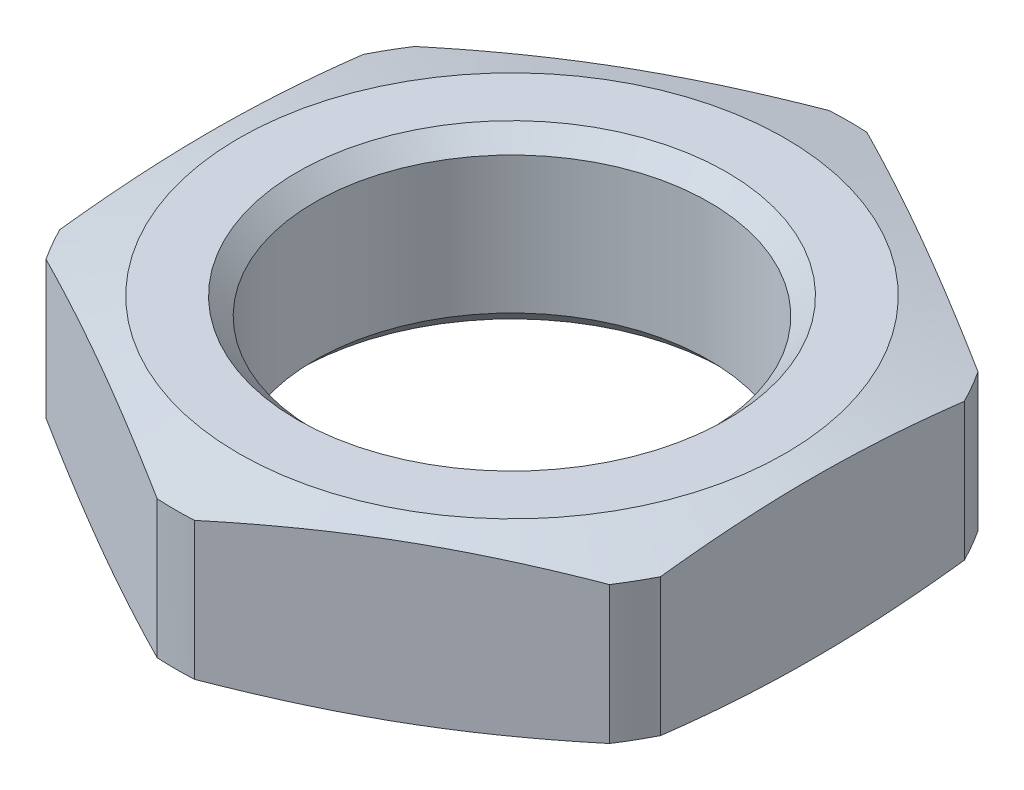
ISO-10303-21;
HEADER;
FILE_DESCRIPTION(('STEP AP214'),'2;1');
FILE_NAME('part.step','',(''),(''),'','','');
FILE_SCHEMA(('AUTOMOTIVE_DESIGN { 1 0 10303 214 1 1 1 1 }'));
ENDSEC;
DATA;
#1=APPLICATION_CONTEXT('core data for automotive mechanical design processes');
#2=APPLICATION_PROTOCOL_DEFINITION('international standard','automotive_design',2000,#1);
#3=PRODUCT_CONTEXT('',#1,'mechanical');
#4=PRODUCT('Part','Part','',(#3));
#5=PRODUCT_RELATED_PRODUCT_CATEGORY('part','',(#4));
#6=PRODUCT_DEFINITION_FORMATION('','',#4);
#7=PRODUCT_DEFINITION_CONTEXT('part definition',#1,'design');
#8=PRODUCT_DEFINITION('design','',#6,#7);
#9=PRODUCT_DEFINITION_SHAPE('','',#8);
#10=(LENGTH_UNIT() NAMED_UNIT(*) SI_UNIT(.MILLI.,.METRE.));
#11=(NAMED_UNIT(*) PLANE_ANGLE_UNIT() SI_UNIT($,.RADIAN.));
#12=(NAMED_UNIT(*) SI_UNIT($,.STERADIAN.) SOLID_ANGLE_UNIT());
#13=UNCERTAINTY_MEASURE_WITH_UNIT(LENGTH_MEASURE(1.E-05),#10,'distance_accuracy_value','');
#14=(GEOMETRIC_REPRESENTATION_CONTEXT(3) GLOBAL_UNCERTAINTY_ASSIGNED_CONTEXT((#13)) GLOBAL_UNIT_ASSIGNED_CONTEXT((#10,
#11,#12)) REPRESENTATION_CONTEXT('',''));
#15=CARTESIAN_POINT('',(0.,0.,0.));
#16=DIRECTION('',(0.,0.,1.));
#17=DIRECTION('',(1.,0.,0.));
#18=AXIS2_PLACEMENT_3D('',#15,#16,#17);
#19=CARTESIAN_POINT('',(0.,0.,0.));
#20=DIRECTION('',(0.,1.,0.));
#21=DIRECTION('',(0.,0.,1.));
#22=AXIS2_PLACEMENT_3D('',#19,#20,#21);
#23=CONICAL_SURFACE('',#22,6.36363636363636,1.30899693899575);
#24=CARTESIAN_POINT('',(0.,0.,0.));
#25=DIRECTION('',(0.,1.,0.));
#26=DIRECTION('',(0.,0.,1.));
#27=AXIS2_PLACEMENT_3D('',#24,#25,#26);
#28=CIRCLE('',#27,6.36363636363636);
#29=CARTESIAN_POINT('',(0.,0.,6.36363636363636));
#30=VERTEX_POINT('',#29);
#31=EDGE_CURVE('E544',#30,#30,#28,.T.);
#32=ORIENTED_EDGE('',*,*,#31,.T.);
#33=EDGE_LOOP('',(#32));
#34=FACE_BOUND('',#33,.T.);
#35=CARTESIAN_POINT('',(0.,0.396431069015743,0.));
#36=DIRECTION('',(0.,1.,0.));
#37=DIRECTION('',(0.,0.,1.));
#38=AXIS2_PLACEMENT_3D('',#35,#36,#37);
#39=CIRCLE('',#38,7.84313725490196);
#40=CARTESIAN_POINT('',(6.56367450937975,0.396431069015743,4.29336452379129));
#41=VERTEX_POINT('',#40);
#42=CARTESIAN_POINT('',(7.,0.396431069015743,3.53762660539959));
#43=VERTEX_POINT('',#42);
#44=EDGE_CURVE('E261',#41,#43,#39,.T.);
#45=ORIENTED_EDGE('',*,*,#44,.F.);
#46=CARTESIAN_POINT('',(-0.000199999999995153,0.4607072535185,8.0830192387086));
#47=CARTESIAN_POINT('',(0.290508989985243,0.415715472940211,7.91517832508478));
#48=CARTESIAN_POINT('',(0.581745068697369,0.37487035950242,7.7470330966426));
#49=CARTESIAN_POINT('',(1.16524574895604,0.303109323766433,7.41014882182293));
#50=CARTESIAN_POINT('',(1.4575107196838,0.272197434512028,7.24140956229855));
#51=CARTESIAN_POINT('',(2.04129717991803,0.222107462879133,6.90436029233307));
#52=CARTESIAN_POINT('',(2.33281472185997,0.20286964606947,6.73605256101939));
#53=CARTESIAN_POINT('',(2.91622156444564,0.177073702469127,6.39922246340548));
#54=CARTESIAN_POINT('',(3.20811078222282,0.170513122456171,6.23070014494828));
#55=CARTESIAN_POINT('',(3.79188921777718,0.170513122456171,5.89365550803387));
#56=CARTESIAN_POINT('',(4.08377843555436,0.177073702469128,5.72513318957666));
#57=CARTESIAN_POINT('',(4.66718527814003,0.20286964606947,5.38830309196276));
#58=CARTESIAN_POINT('',(4.95870282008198,0.222107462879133,5.21999536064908));
#59=CARTESIAN_POINT('',(5.5424892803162,0.272197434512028,4.88294609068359));
#60=CARTESIAN_POINT('',(5.83475425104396,0.303109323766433,4.71420683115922));
#61=CARTESIAN_POINT('',(6.41825493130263,0.37487035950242,4.37732255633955));
#62=CARTESIAN_POINT('',(6.70949101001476,0.415715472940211,4.20917732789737));
#63=CARTESIAN_POINT('',(7.0002,0.460707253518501,4.04133641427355));
#64=B_SPLINE_CURVE_WITH_KNOTS('',3,(#46,#47,#48,#49,#50,#51,#52,#53,#54,#55,#56,#57,#58,#59,#60,
#61,#62,#63),.UNSPECIFIED.,.F.,.F.,(4,2,2,2,2,2,2,2,4),(0.,1.01610389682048,2.03261982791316,
3.04388955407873,4.05496356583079,5.06603757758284,6.07730730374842,7.0938232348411,
8.10992713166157),.UNSPECIFIED.);
#65=CARTESIAN_POINT('',(0.436325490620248,0.396431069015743,7.83099112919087));
#66=VERTEX_POINT('',#65);
#67=EDGE_CURVE('E169',#66,#41,#64,.T.);
#68=ORIENTED_EDGE('',*,*,#67,.F.);
#69=CARTESIAN_POINT('',(-0.436325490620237,0.396431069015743,7.83099112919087));
#70=VERTEX_POINT('',#69);
#71=EDGE_CURVE('E246',#70,#66,#39,.T.);
#72=ORIENTED_EDGE('',*,*,#71,.F.);
#73=CARTESIAN_POINT('',(-7.0002,0.4607072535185,4.04133641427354));
#74=CARTESIAN_POINT('',(-6.70949101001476,0.415715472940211,4.20917732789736));
#75=CARTESIAN_POINT('',(-6.41825493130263,0.374870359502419,4.37732255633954));
#76=CARTESIAN_POINT('',(-5.83475425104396,0.303109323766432,4.71420683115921));
#77=CARTESIAN_POINT('',(-5.5424892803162,0.272197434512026,4.88294609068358));
#78=CARTESIAN_POINT('',(-4.95870282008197,0.222107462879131,5.21999536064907));
#79=CARTESIAN_POINT('',(-4.66718527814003,0.202869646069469,5.38830309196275));
#80=CARTESIAN_POINT('',(-4.08377843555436,0.177073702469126,5.72513318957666));
#81=CARTESIAN_POINT('',(-3.79188921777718,0.170513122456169,5.89365550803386));
#82=CARTESIAN_POINT('',(-3.20811078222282,0.170513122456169,6.23070014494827));
#83=CARTESIAN_POINT('',(-2.91622156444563,0.177073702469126,6.39922246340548));
#84=CARTESIAN_POINT('',(-2.33281472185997,0.202869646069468,6.73605256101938));
#85=CARTESIAN_POINT('',(-2.04129717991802,0.222107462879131,6.90436029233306));
#86=CARTESIAN_POINT('',(-1.45751071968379,0.272197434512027,7.24140956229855));
#87=CARTESIAN_POINT('',(-1.16524574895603,0.303109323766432,7.41014882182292));
#88=CARTESIAN_POINT('',(-0.581745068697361,0.374870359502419,7.7470330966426));
#89=CARTESIAN_POINT('',(-0.290508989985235,0.41571547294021,7.91517832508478));
#90=CARTESIAN_POINT('',(0.000200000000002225,0.4607072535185,8.0830192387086));
#91=B_SPLINE_CURVE_WITH_KNOTS('',3,(#73,#74,#75,#76,#77,#78,#79,#80,#81,#82,#83,#84,#85,#86,#87,
#88,#89,#90),.UNSPECIFIED.,.F.,.F.,(4,2,2,2,2,2,2,2,4),(0.,1.01610389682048,2.03261982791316,
3.04388955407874,4.05496356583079,5.06603757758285,6.07730730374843,7.09382323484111,
8.10992713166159),.UNSPECIFIED.);
#92=CARTESIAN_POINT('',(-6.56367450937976,0.396431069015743,4.29336452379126));
#93=VERTEX_POINT('',#92);
#94=EDGE_CURVE('E162',#93,#70,#91,.T.);
#95=ORIENTED_EDGE('',*,*,#94,.F.);
#96=CARTESIAN_POINT('',(-7.,0.396431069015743,3.53762660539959));
#97=VERTEX_POINT('',#96);
#98=EDGE_CURVE('E109',#97,#93,#39,.T.);
#99=ORIENTED_EDGE('',*,*,#98,.F.);
#100=CARTESIAN_POINT('',(-7.,1.73978588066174,-10.7838911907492));
#101=CARTESIAN_POINT('',(-7.,1.66818178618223,-10.4652137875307));
#102=CARTESIAN_POINT('',(-7.,1.59743810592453,-10.1463395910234));
#103=CARTESIAN_POINT('',(-7.,1.4581362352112,-9.50810074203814));
#104=CARTESIAN_POINT('',(-7.,1.38957813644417,-9.18873606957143));
#105=CARTESIAN_POINT('',(-7.,1.25505548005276,-8.54914803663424));
#106=CARTESIAN_POINT('',(-7.,1.18909340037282,-8.22892415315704));
#107=CARTESIAN_POINT('',(-7.,1.06045981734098,-7.58781648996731));
#108=CARTESIAN_POINT('',(-7.,0.997788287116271,-7.26693271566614));
#109=CARTESIAN_POINT('',(-7.,0.87701672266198,-6.62701248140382));
#110=CARTESIAN_POINT('',(-7.,0.818883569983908,-6.30798230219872));
#111=CARTESIAN_POINT('',(-7.,0.707591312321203,-5.66905700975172));
#112=CARTESIAN_POINT('',(-7.,0.654432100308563,-5.34916191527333));
#113=CARTESIAN_POINT('',(-7.,0.554264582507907,-4.70843222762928));
#114=CARTESIAN_POINT('',(-7.,0.507255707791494,-4.38759772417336));
#115=CARTESIAN_POINT('',(-7.,0.420757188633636,-3.74490502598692));
#116=CARTESIAN_POINT('',(-7.,0.381267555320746,-3.42304682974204));
#117=CARTESIAN_POINT('',(-7.,0.310903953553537,-2.77462805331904));
#118=CARTESIAN_POINT('',(-7.,0.280134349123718,-2.44805597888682));
#119=CARTESIAN_POINT('',(-7.,0.229322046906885,-1.79407107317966));
#120=CARTESIAN_POINT('',(-7.,0.209279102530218,-1.46665826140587));
#121=CARTESIAN_POINT('',(-7.,0.181087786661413,-0.811472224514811));
#122=CARTESIAN_POINT('',(-7.,0.172933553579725,-0.483699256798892));
#123=CARTESIAN_POINT('',(-7.,0.169022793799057,0.171921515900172));
#124=CARTESIAN_POINT('',(-7.,0.173266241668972,0.499769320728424));
#125=CARTESIAN_POINT('',(-7.,0.193915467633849,1.15634331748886));
#126=CARTESIAN_POINT('',(-7.,0.210368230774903,1.48506800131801));
#127=CARTESIAN_POINT('',(-7.,0.25449142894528,2.1417567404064));
#128=CARTESIAN_POINT('',(-7.,0.282162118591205,2.4697207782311));
#129=CARTESIAN_POINT('',(-7.,0.347300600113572,3.12488676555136));
#130=CARTESIAN_POINT('',(-7.,0.384775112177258,3.45208803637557));
#131=CARTESIAN_POINT('',(-7.,0.467933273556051,4.10543323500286));
#132=CARTESIAN_POINT('',(-7.,0.513616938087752,4.43157716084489));
#133=CARTESIAN_POINT('',(-7.,0.611900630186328,5.08415244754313));
#134=CARTESIAN_POINT('',(-7.,0.66452772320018,5.41057969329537));
#135=CARTESIAN_POINT('',(-7.,0.775251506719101,6.06251019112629));
#136=CARTESIAN_POINT('',(-7.,0.833348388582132,6.38801341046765));
#137=CARTESIAN_POINT('',(-7.,0.953942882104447,7.038242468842));
#138=CARTESIAN_POINT('',(-7.,1.01644105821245,7.36296820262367));
#139=CARTESIAN_POINT('',(-7.,1.14497004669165,8.01171294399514));
#140=CARTESIAN_POINT('',(-7.,1.21100081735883,8.33573195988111));
#141=CARTESIAN_POINT('',(-7.,1.34593717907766,8.98328169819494));
#142=CARTESIAN_POINT('',(-7.,1.414843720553,9.30681222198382));
#143=CARTESIAN_POINT('',(-7.,1.55498090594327,9.95337030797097));
#144=CARTESIAN_POINT('',(-7.,1.62621156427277,10.2763978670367));
#145=CARTESIAN_POINT('',(-7.,1.84272337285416,11.2447929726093));
#146=CARTESIAN_POINT('',(-7.,1.99083580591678,11.8895271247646));
#147=CARTESIAN_POINT('',(-7.,2.29056643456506,13.1707259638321));
#148=CARTESIAN_POINT('',(-7.,2.44212846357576,13.8072038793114));
#149=CARTESIAN_POINT('',(-7.,2.74886282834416,15.0793030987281));
#150=CARTESIAN_POINT('',(-7.,2.90403524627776,15.7149243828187));
#151=CARTESIAN_POINT('',(-7.,3.21678497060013,16.9846075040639));
#152=CARTESIAN_POINT('',(-7.,3.37435851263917,17.6186702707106));
#153=CARTESIAN_POINT('',(-7.,3.69150941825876,18.8862699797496));
#154=CARTESIAN_POINT('',(-7.,3.8510867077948,19.5198069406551));
#155=CARTESIAN_POINT('',(-7.,4.01136283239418,20.1531651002));
#156=B_SPLINE_CURVE_WITH_KNOTS('',3,(#100,#101,#102,#103,#104,#105,#106,#107,#108,#109,#110,
#111,#112,#113,#114,#115,#116,#117,#118,#119,#120,#121,#122,#123,#124,#125,#126,#127,#128,#129,
#130,#131,#132,#133,#134,#135,#136,#137,#138,#139,#140,#141,#142,#143,#144,#145,#146,#147,#148,
#149,#150,#151,#152,#153,#154,#155),.UNSPECIFIED.,.F.,.F.,(4,2,2,2,2,2,2,2,2,2,2,2,2,2,2,2,2,2,
2,2,2,2,2,2,2,2,2,4),(0.,0.979872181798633,1.95978541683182,2.94061236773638,3.92143130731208,
4.89425006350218,5.86704788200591,6.83975564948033,7.8124648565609,8.79636648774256,
9.78024549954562,10.7636392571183,11.7470309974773,12.7342268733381,13.7214451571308,
14.7093419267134,15.6972405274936,16.6891104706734,17.6810151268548,18.6730472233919,
19.6650676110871,20.6574184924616,21.649775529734,23.6343234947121,25.5971349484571,
27.5599911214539,29.5200348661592,31.4800063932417),.UNSPECIFIED.);
#157=CARTESIAN_POINT('',(-7.,0.396431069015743,-3.53762660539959));
#158=VERTEX_POINT('',#157);
#159=EDGE_CURVE('E208',#158,#97,#156,.T.);
#160=ORIENTED_EDGE('',*,*,#159,.F.);
#161=CARTESIAN_POINT('',(-6.56367450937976,0.396431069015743,-4.29336452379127));
#162=VERTEX_POINT('',#161);
#163=EDGE_CURVE('E249',#162,#158,#39,.T.);
#164=ORIENTED_EDGE('',*,*,#163,.F.);
#165=CARTESIAN_POINT('',(0.000200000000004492,0.460707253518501,-8.0830192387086));
#166=CARTESIAN_POINT('',(-0.290508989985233,0.415715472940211,-7.91517832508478));
#167=CARTESIAN_POINT('',(-0.58174506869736,0.374870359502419,-7.7470330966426));
#168=CARTESIAN_POINT('',(-1.16524574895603,0.303109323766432,-7.41014882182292));
#169=CARTESIAN_POINT('',(-1.45751071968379,0.272197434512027,-7.24140956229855));
#170=CARTESIAN_POINT('',(-2.04129717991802,0.222107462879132,-6.90436029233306));
#171=CARTESIAN_POINT('',(-2.33281472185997,0.202869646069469,-6.73605256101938));
#172=CARTESIAN_POINT('',(-2.91622156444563,0.177073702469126,-6.39922246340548));
#173=CARTESIAN_POINT('',(-3.20811078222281,0.170513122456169,-6.23070014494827));
#174=CARTESIAN_POINT('',(-3.79188921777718,0.170513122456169,-5.89365550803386));
#175=CARTESIAN_POINT('',(-4.08377843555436,0.177073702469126,-5.72513318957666));
#176=CARTESIAN_POINT('',(-4.66718527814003,0.202869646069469,-5.38830309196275));
#177=CARTESIAN_POINT('',(-4.95870282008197,0.222107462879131,-5.21999536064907));
#178=CARTESIAN_POINT('',(-5.5424892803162,0.272197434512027,-4.88294609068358));
#179=CARTESIAN_POINT('',(-5.83475425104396,0.303109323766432,-4.71420683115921));
#180=CARTESIAN_POINT('',(-6.41825493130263,0.374870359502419,-4.37732255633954));
#181=CARTESIAN_POINT('',(-6.70949101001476,0.41571547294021,-4.20917732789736));
#182=CARTESIAN_POINT('',(-7.0002,0.4607072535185,-4.04133641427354));
#183=B_SPLINE_CURVE_WITH_KNOTS('',3,(#165,#166,#167,#168,#169,#170,#171,#172,#173,#174,#175,
#176,#177,#178,#179,#180,#181,#182),.UNSPECIFIED.,.F.,.F.,(4,2,2,2,2,2,2,2,4),(0.,
1.01610389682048,2.03261982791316,3.04388955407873,4.05496356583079,5.06603757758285,
6.07730730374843,7.09382323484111,8.10992713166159),.UNSPECIFIED.);
#184=CARTESIAN_POINT('',(-0.436325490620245,0.396431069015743,-7.83099112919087));
#185=VERTEX_POINT('',#184);
#186=EDGE_CURVE('E201',#185,#162,#183,.T.);
#187=ORIENTED_EDGE('',*,*,#186,.F.);
#188=CARTESIAN_POINT('',(0.436325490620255,0.396431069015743,-7.83099112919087));
#189=VERTEX_POINT('',#188);
#190=EDGE_CURVE('E274',#189,#185,#39,.T.);
#191=ORIENTED_EDGE('',*,*,#190,.F.);
#192=CARTESIAN_POINT('',(7.0002,0.4607072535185,-4.04133641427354));
#193=CARTESIAN_POINT('',(6.70949101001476,0.415715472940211,-4.20917732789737));
#194=CARTESIAN_POINT('',(6.41825493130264,0.37487035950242,-4.37732255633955));
#195=CARTESIAN_POINT('',(5.83475425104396,0.303109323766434,-4.71420683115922));
#196=CARTESIAN_POINT('',(5.5424892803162,0.272197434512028,-4.88294609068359));
#197=CARTESIAN_POINT('',(4.95870282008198,0.222107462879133,-5.21999536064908));
#198=CARTESIAN_POINT('',(4.66718527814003,0.202869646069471,-5.38830309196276));
#199=CARTESIAN_POINT('',(4.08377843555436,0.177073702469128,-5.72513318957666));
#200=CARTESIAN_POINT('',(3.79188921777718,0.170513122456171,-5.89365550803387));
#201=CARTESIAN_POINT('',(3.20811078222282,0.170513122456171,-6.23070014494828));
#202=CARTESIAN_POINT('',(2.91622156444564,0.177073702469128,-6.39922246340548));
#203=CARTESIAN_POINT('',(2.33281472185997,0.202869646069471,-6.73605256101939));
#204=CARTESIAN_POINT('',(2.04129717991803,0.222107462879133,-6.90436029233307));
#205=CARTESIAN_POINT('',(1.4575107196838,0.272197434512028,-7.24140956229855));
#206=CARTESIAN_POINT('',(1.16524574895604,0.303109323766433,-7.41014882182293));
#207=CARTESIAN_POINT('',(0.581745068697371,0.37487035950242,-7.7470330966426));
#208=CARTESIAN_POINT('',(0.290508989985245,0.415715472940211,-7.91517832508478));
#209=CARTESIAN_POINT('',(-0.000199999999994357,0.460707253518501,-8.0830192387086));
#210=B_SPLINE_CURVE_WITH_KNOTS('',3,(#192,#193,#194,#195,#196,#197,#198,#199,#200,#201,#202,
#203,#204,#205,#206,#207,#208,#209),.UNSPECIFIED.,.F.,.F.,(4,2,2,2,2,2,2,2,4),(0.,
1.01610389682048,2.03261982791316,3.04388955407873,4.05496356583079,5.06603757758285,
6.07730730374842,7.0938232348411,8.10992713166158),.UNSPECIFIED.);
#211=CARTESIAN_POINT('',(6.56367450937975,0.396431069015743,-4.29336452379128));
#212=VERTEX_POINT('',#211);
#213=EDGE_CURVE('E194',#212,#189,#210,.T.);
#214=ORIENTED_EDGE('',*,*,#213,.F.);
#215=CARTESIAN_POINT('',(7.,0.396431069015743,-3.53762660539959));
#216=VERTEX_POINT('',#215);
#217=EDGE_CURVE('E269',#216,#212,#39,.T.);
#218=ORIENTED_EDGE('',*,*,#217,.F.);
#219=CARTESIAN_POINT('',(7.,1.73978588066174,-10.7838911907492));
#220=CARTESIAN_POINT('',(7.,1.66818178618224,-10.4652137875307));
#221=CARTESIAN_POINT('',(7.,1.59743810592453,-10.1463395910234));
#222=CARTESIAN_POINT('',(7.,1.4581362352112,-9.50810074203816));
#223=CARTESIAN_POINT('',(7.,1.38957813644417,-9.18873606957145));
#224=CARTESIAN_POINT('',(7.,1.25505548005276,-8.54914803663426));
#225=CARTESIAN_POINT('',(7.,1.18909340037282,-8.22892415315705));
#226=CARTESIAN_POINT('',(7.,1.06045981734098,-7.58781648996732));
#227=CARTESIAN_POINT('',(7.,0.997788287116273,-7.26693271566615));
#228=CARTESIAN_POINT('',(7.,0.877016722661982,-6.62701248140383));
#229=CARTESIAN_POINT('',(7.,0.818883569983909,-6.30798230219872));
#230=CARTESIAN_POINT('',(7.,0.707591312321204,-5.66905700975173));
#231=CARTESIAN_POINT('',(7.,0.654432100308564,-5.34916191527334));
#232=CARTESIAN_POINT('',(7.,0.554264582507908,-4.70843222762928));
#233=CARTESIAN_POINT('',(7.,0.507255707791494,-4.38759772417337));
#234=CARTESIAN_POINT('',(7.,0.420757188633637,-3.74490502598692));
#235=CARTESIAN_POINT('',(7.,0.381267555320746,-3.42304682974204));
#236=CARTESIAN_POINT('',(7.,0.310903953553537,-2.77462805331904));
#237=CARTESIAN_POINT('',(7.,0.280134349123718,-2.44805597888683));
#238=CARTESIAN_POINT('',(7.,0.229322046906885,-1.79407107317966));
#239=CARTESIAN_POINT('',(7.,0.209279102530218,-1.46665826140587));
#240=CARTESIAN_POINT('',(7.,0.181087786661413,-0.811472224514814));
#241=CARTESIAN_POINT('',(7.,0.172933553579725,-0.483699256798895));
#242=CARTESIAN_POINT('',(7.,0.169022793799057,0.171921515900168));
#243=CARTESIAN_POINT('',(7.,0.173266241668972,0.49976932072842));
#244=CARTESIAN_POINT('',(7.,0.193915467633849,1.15634331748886));
#245=CARTESIAN_POINT('',(7.,0.210368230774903,1.485068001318));
#246=CARTESIAN_POINT('',(7.,0.254491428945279,2.14175674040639));
#247=CARTESIAN_POINT('',(7.,0.282162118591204,2.46972077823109));
#248=CARTESIAN_POINT('',(7.,0.347300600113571,3.12488676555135));
#249=CARTESIAN_POINT('',(7.,0.384775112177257,3.45208803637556));
#250=CARTESIAN_POINT('',(7.,0.46793327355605,4.10543323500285));
#251=CARTESIAN_POINT('',(7.,0.513616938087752,4.43157716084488));
#252=CARTESIAN_POINT('',(7.,0.611900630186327,5.08415244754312));
#253=CARTESIAN_POINT('',(7.,0.664527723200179,5.41057969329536));
#254=CARTESIAN_POINT('',(7.,0.775251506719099,6.06251019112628));
#255=CARTESIAN_POINT('',(7.,0.833348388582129,6.38801341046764));
#256=CARTESIAN_POINT('',(7.,0.953942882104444,7.03824246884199));
#257=CARTESIAN_POINT('',(7.,1.01644105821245,7.36296820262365));
#258=CARTESIAN_POINT('',(7.,1.14497004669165,8.01171294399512));
#259=CARTESIAN_POINT('',(7.,1.21100081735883,8.3357319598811));
#260=CARTESIAN_POINT('',(7.,1.34593717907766,8.98328169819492));
#261=CARTESIAN_POINT('',(7.,1.41484372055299,9.3068122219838));
#262=CARTESIAN_POINT('',(7.,1.55498090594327,9.95337030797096));
#263=CARTESIAN_POINT('',(7.,1.62621156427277,10.2763978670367));
#264=CARTESIAN_POINT('',(7.,1.84272337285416,11.2447929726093));
#265=CARTESIAN_POINT('',(7.,1.99083580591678,11.8895271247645));
#266=CARTESIAN_POINT('',(7.,2.29056643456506,13.1707259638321));
#267=CARTESIAN_POINT('',(7.,2.44212846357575,13.8072038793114));
#268=CARTESIAN_POINT('',(7.,2.74886282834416,15.0793030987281));
#269=CARTESIAN_POINT('',(7.,2.90403524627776,15.7149243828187));
#270=CARTESIAN_POINT('',(7.,3.21678497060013,16.9846075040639));
#271=CARTESIAN_POINT('',(7.,3.37435851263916,17.6186702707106));
#272=CARTESIAN_POINT('',(7.,3.69150941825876,18.8862699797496));
#273=CARTESIAN_POINT('',(7.,3.8510867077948,19.5198069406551));
#274=CARTESIAN_POINT('',(7.,4.01136283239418,20.1531651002));
#275=B_SPLINE_CURVE_WITH_KNOTS('',3,(#219,#220,#221,#222,#223,#224,#225,#226,#227,#228,#229,
#230,#231,#232,#233,#234,#235,#236,#237,#238,#239,#240,#241,#242,#243,#244,#245,#246,#247,#248,
#249,#250,#251,#252,#253,#254,#255,#256,#257,#258,#259,#260,#261,#262,#263,#264,#265,#266,#267,
#268,#269,#270,#271,#272,#273,#274),.UNSPECIFIED.,.F.,.F.,(4,2,2,2,2,2,2,2,2,2,2,2,2,2,2,2,2,2,
2,2,2,2,2,2,2,2,2,4),(0.,0.979872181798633,1.95978541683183,2.94061236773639,3.92143130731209,
4.8942500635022,5.86704788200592,6.83975564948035,7.81246485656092,8.79636648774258,
9.78024549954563,10.7636392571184,11.7470309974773,12.7342268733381,13.7214451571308,
14.7093419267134,15.6972405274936,16.6891104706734,17.6810151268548,18.6730472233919,
19.6650676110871,20.6574184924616,21.649775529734,23.6343234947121,25.5971349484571,
27.5599911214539,29.5200348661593,31.4800063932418),.UNSPECIFIED.);
#276=EDGE_CURVE('E188',#43,#216,#275,.F.);
#277=ORIENTED_EDGE('',*,*,#276,.F.);
#278=EDGE_LOOP('',(#45,#68,#72,#95,#99,#160,#164,#187,#191,#214,#218,#277));
#279=FACE_BOUND('',#278,.T.);
#280=ADVANCED_FACE('F16',(#34,#279),#23,.T.);
#281=CARTESIAN_POINT('',(0.,2.,0.));
#282=DIRECTION('',(0.,-1.,0.));
#283=DIRECTION('',(0.,0.,-1.));
#284=AXIS2_PLACEMENT_3D('',#281,#282,#283);
#285=CONICAL_SURFACE('',#284,13.8277379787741,1.30899693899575);
#286=CARTESIAN_POINT('',(0.,4.,0.));
#287=DIRECTION('',(0.,1.,0.));
#288=DIRECTION('',(0.,0.,1.));
#289=AXIS2_PLACEMENT_3D('',#286,#287,#288);
#290=CIRCLE('',#289,6.36363636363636);
#291=CARTESIAN_POINT('',(0.,4.,6.36363636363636));
#292=VERTEX_POINT('',#291);
#293=EDGE_CURVE('E539',#292,#292,#290,.T.);
#294=ORIENTED_EDGE('',*,*,#293,.F.);
#295=EDGE_LOOP('',(#294));
#296=FACE_BOUND('',#295,.T.);
#297=CARTESIAN_POINT('',(0.,3.60356893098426,0.));
#298=DIRECTION('',(0.,-1.,0.));
#299=DIRECTION('',(0.,0.,-1.));
#300=AXIS2_PLACEMENT_3D('',#297,#298,#299);
#301=CIRCLE('',#300,7.84313725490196);
#302=CARTESIAN_POINT('',(6.56367450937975,3.60356893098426,-4.29336452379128));
#303=VERTEX_POINT('',#302);
#304=CARTESIAN_POINT('',(7.,3.60356893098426,-3.53762660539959));
#305=VERTEX_POINT('',#304);
#306=EDGE_CURVE('E264',#303,#305,#301,.T.);
#307=ORIENTED_EDGE('',*,*,#306,.F.);
#308=CARTESIAN_POINT('',(-0.000199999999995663,3.5392927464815,-8.0830192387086));
#309=CARTESIAN_POINT('',(0.290508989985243,3.58428452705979,-7.91517832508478));
#310=CARTESIAN_POINT('',(0.581745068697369,3.62512964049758,-7.7470330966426));
#311=CARTESIAN_POINT('',(1.16524574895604,3.69689067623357,-7.41014882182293));
#312=CARTESIAN_POINT('',(1.4575107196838,3.72780256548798,-7.24140956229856));
#313=CARTESIAN_POINT('',(2.04129717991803,3.77789253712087,-6.90436029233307));
#314=CARTESIAN_POINT('',(2.33281472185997,3.79713035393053,-6.73605256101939));
#315=CARTESIAN_POINT('',(2.91622156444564,3.82292629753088,-6.39922246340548));
#316=CARTESIAN_POINT('',(3.20811078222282,3.82948687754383,-6.23070014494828));
#317=CARTESIAN_POINT('',(3.79188921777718,3.82948687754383,-5.89365550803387));
#318=CARTESIAN_POINT('',(4.08377843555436,3.82292629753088,-5.72513318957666));
#319=CARTESIAN_POINT('',(4.66718527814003,3.79713035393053,-5.38830309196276));
#320=CARTESIAN_POINT('',(4.95870282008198,3.77789253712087,-5.21999536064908));
#321=CARTESIAN_POINT('',(5.5424892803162,3.72780256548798,-4.88294609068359));
#322=CARTESIAN_POINT('',(5.83475425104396,3.69689067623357,-4.71420683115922));
#323=CARTESIAN_POINT('',(6.41825493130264,3.62512964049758,-4.37732255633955));
#324=CARTESIAN_POINT('',(6.70949101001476,3.58428452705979,-4.20917732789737));
#325=CARTESIAN_POINT('',(7.0002,3.5392927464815,-4.04133641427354));
#326=B_SPLINE_CURVE_WITH_KNOTS('',3,(#308,#309,#310,#311,#312,#313,#314,#315,#316,#317,#318,
#319,#320,#321,#322,#323,#324,#325),.UNSPECIFIED.,.F.,.F.,(4,2,2,2,2,2,2,2,4),(0.,
1.01610389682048,2.03261982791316,3.04388955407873,4.05496356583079,5.06603757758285,
6.07730730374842,7.0938232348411,8.10992713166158),.UNSPECIFIED.);
#327=CARTESIAN_POINT('',(0.436325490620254,3.60356893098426,-7.83099112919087));
#328=VERTEX_POINT('',#327);
#329=EDGE_CURVE('E231',#328,#303,#326,.T.);
#330=ORIENTED_EDGE('',*,*,#329,.F.);
#331=CARTESIAN_POINT('',(-0.436325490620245,3.60356893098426,-7.83099112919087));
#332=VERTEX_POINT('',#331);
#333=EDGE_CURVE('E39',#332,#328,#301,.T.);
#334=ORIENTED_EDGE('',*,*,#333,.F.);
#335=CARTESIAN_POINT('',(-7.0002,3.5392927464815,-4.04133641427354));
#336=CARTESIAN_POINT('',(-6.70949101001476,3.58428452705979,-4.20917732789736));
#337=CARTESIAN_POINT('',(-6.41825493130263,3.62512964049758,-4.37732255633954));
#338=CARTESIAN_POINT('',(-5.83475425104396,3.69689067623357,-4.71420683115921));
#339=CARTESIAN_POINT('',(-5.5424892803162,3.72780256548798,-4.88294609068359));
#340=CARTESIAN_POINT('',(-4.95870282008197,3.77789253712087,-5.21999536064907));
#341=CARTESIAN_POINT('',(-4.66718527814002,3.79713035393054,-5.38830309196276));
#342=CARTESIAN_POINT('',(-4.08377843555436,3.82292629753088,-5.72513318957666));
#343=CARTESIAN_POINT('',(-3.79188921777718,3.82948687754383,-5.89365550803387));
#344=CARTESIAN_POINT('',(-3.20811078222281,3.82948687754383,-6.23070014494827));
#345=CARTESIAN_POINT('',(-2.91622156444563,3.82292629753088,-6.39922246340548));
#346=CARTESIAN_POINT('',(-2.33281472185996,3.79713035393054,-6.73605256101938));
#347=CARTESIAN_POINT('',(-2.04129717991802,3.77789253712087,-6.90436029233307));
#348=CARTESIAN_POINT('',(-1.45751071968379,3.72780256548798,-7.24140956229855));
#349=CARTESIAN_POINT('',(-1.16524574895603,3.69689067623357,-7.41014882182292));
#350=CARTESIAN_POINT('',(-0.581745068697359,3.62512964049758,-7.7470330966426));
#351=CARTESIAN_POINT('',(-0.290508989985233,3.58428452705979,-7.91517832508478));
#352=CARTESIAN_POINT('',(0.000200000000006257,3.5392927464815,-8.0830192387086));
#353=B_SPLINE_CURVE_WITH_KNOTS('',3,(#335,#336,#337,#338,#339,#340,#341,#342,#343,#344,#345,
#346,#347,#348,#349,#350,#351,#352),.UNSPECIFIED.,.F.,.F.,(4,2,2,2,2,2,2,2,4),(0.,
1.01610389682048,2.03261982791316,3.04388955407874,4.05496356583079,5.06603757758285,
6.07730730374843,7.09382323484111,8.10992713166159),.UNSPECIFIED.);
#354=CARTESIAN_POINT('',(-6.56367450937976,3.60356893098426,-4.29336452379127));
#355=VERTEX_POINT('',#354);
#356=EDGE_CURVE('E223',#355,#332,#353,.T.);
#357=ORIENTED_EDGE('',*,*,#356,.F.);
#358=CARTESIAN_POINT('',(-7.,3.60356893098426,-3.53762660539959));
#359=VERTEX_POINT('',#358);
#360=EDGE_CURVE('E31',#359,#355,#301,.T.);
#361=ORIENTED_EDGE('',*,*,#360,.F.);
#362=CARTESIAN_POINT('',(-7.,2.26021411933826,-10.7838911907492));
#363=CARTESIAN_POINT('',(-7.,2.33181821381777,-10.4652137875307));
#364=CARTESIAN_POINT('',(-7.,2.40256189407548,-10.1463395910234));
#365=CARTESIAN_POINT('',(-7.,2.54186376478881,-9.50810074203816));
#366=CARTESIAN_POINT('',(-7.,2.61042186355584,-9.18873606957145));
#367=CARTESIAN_POINT('',(-7.,2.74494451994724,-8.54914803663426));
#368=CARTESIAN_POINT('',(-7.,2.81090659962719,-8.22892415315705));
#369=CARTESIAN_POINT('',(-7.,2.93954018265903,-7.58781648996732));
#370=CARTESIAN_POINT('',(-7.,3.00221171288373,-7.26693271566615));
#371=CARTESIAN_POINT('',(-7.,3.12298327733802,-6.62701248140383));
#372=CARTESIAN_POINT('',(-7.,3.18111643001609,-6.30798230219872));
#373=CARTESIAN_POINT('',(-7.,3.2924086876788,-5.66905700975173));
#374=CARTESIAN_POINT('',(-7.,3.34556789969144,-5.34916191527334));
#375=CARTESIAN_POINT('',(-7.,3.4457354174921,-4.70843222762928));
#376=CARTESIAN_POINT('',(-7.,3.49274429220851,-4.38759772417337));
#377=CARTESIAN_POINT('',(-7.,3.57924281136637,-3.74490502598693));
#378=CARTESIAN_POINT('',(-7.,3.61873244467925,-3.42304682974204));
#379=CARTESIAN_POINT('',(-7.,3.68909604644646,-2.77462805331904));
#380=CARTESIAN_POINT('',(-7.,3.71986565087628,-2.44805597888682));
#381=CARTESIAN_POINT('',(-7.,3.77067795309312,-1.79407107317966));
#382=CARTESIAN_POINT('',(-7.,3.79072089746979,-1.46665826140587));
#383=CARTESIAN_POINT('',(-7.,3.81891221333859,-0.811472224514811));
#384=CARTESIAN_POINT('',(-7.,3.82706644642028,-0.483699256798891));
#385=CARTESIAN_POINT('',(-7.,3.83097720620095,0.171921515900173));
#386=CARTESIAN_POINT('',(-7.,3.82673375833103,0.499769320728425));
#387=CARTESIAN_POINT('',(-7.,3.80608453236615,1.15634331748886));
#388=CARTESIAN_POINT('',(-7.,3.7896317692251,1.48506800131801));
#389=CARTESIAN_POINT('',(-7.,3.74550857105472,2.1417567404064));
#390=CARTESIAN_POINT('',(-7.,3.7178378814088,2.4697207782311));
#391=CARTESIAN_POINT('',(-7.,3.65269939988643,3.12488676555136));
#392=CARTESIAN_POINT('',(-7.,3.61522488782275,3.45208803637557));
#393=CARTESIAN_POINT('',(-7.,3.53206672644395,4.10543323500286));
#394=CARTESIAN_POINT('',(-7.,3.48638306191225,4.43157716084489));
#395=CARTESIAN_POINT('',(-7.,3.38809936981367,5.08415244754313));
#396=CARTESIAN_POINT('',(-7.,3.33547227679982,5.41057969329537));
#397=CARTESIAN_POINT('',(-7.,3.2247484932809,6.06251019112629));
#398=CARTESIAN_POINT('',(-7.,3.16665161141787,6.38801341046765));
#399=CARTESIAN_POINT('',(-7.,3.04605711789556,7.038242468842));
#400=CARTESIAN_POINT('',(-7.,2.98355894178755,7.36296820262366));
#401=CARTESIAN_POINT('',(-7.,2.85502995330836,8.01171294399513));
#402=CARTESIAN_POINT('',(-7.,2.78899918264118,8.33573195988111));
#403=CARTESIAN_POINT('',(-7.,2.65406282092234,8.98328169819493));
#404=CARTESIAN_POINT('',(-7.,2.58515627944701,9.30681222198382));
#405=CARTESIAN_POINT('',(-7.,2.44501909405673,9.95337030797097));
#406=CARTESIAN_POINT('',(-7.,2.37378843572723,10.2763978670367));
#407=CARTESIAN_POINT('',(-7.,2.15727662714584,11.2447929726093));
#408=CARTESIAN_POINT('',(-7.,2.00916419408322,11.8895271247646));
#409=CARTESIAN_POINT('',(-7.,1.70943356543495,13.1707259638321));
#410=CARTESIAN_POINT('',(-7.,1.55787153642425,13.8072038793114));
#411=CARTESIAN_POINT('',(-7.,1.25113717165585,15.0793030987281));
#412=CARTESIAN_POINT('',(-7.,1.09596475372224,15.7149243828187));
#413=CARTESIAN_POINT('',(-7.,0.783215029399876,16.9846075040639));
#414=CARTESIAN_POINT('',(-7.,0.625641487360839,17.6186702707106));
#415=CARTESIAN_POINT('',(-7.,0.308490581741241,18.8862699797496));
#416=CARTESIAN_POINT('',(-7.,0.148913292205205,19.5198069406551));
#417=CARTESIAN_POINT('',(-7.,-0.0113628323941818,20.1531651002));
#418=B_SPLINE_CURVE_WITH_KNOTS('',3,(#362,#363,#364,#365,#366,#367,#368,#369,#370,#371,#372,
#373,#374,#375,#376,#377,#378,#379,#380,#381,#382,#383,#384,#385,#386,#387,#388,#389,#390,#391,
#392,#393,#394,#395,#396,#397,#398,#399,#400,#401,#402,#403,#404,#405,#406,#407,#408,#409,#410,
#411,#412,#413,#414,#415,#416,#417),.UNSPECIFIED.,.F.,.F.,(4,2,2,2,2,2,2,2,2,2,2,2,2,2,2,2,2,2,
2,2,2,2,2,2,2,2,2,4),(0.,0.979872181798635,1.95978541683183,2.94061236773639,3.92143130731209,
4.8942500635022,5.86704788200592,6.83975564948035,7.81246485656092,8.79636648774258,
9.78024549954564,10.7636392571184,11.7470309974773,12.7342268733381,13.7214451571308,
14.7093419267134,15.6972405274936,16.6891104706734,17.6810151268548,18.6730472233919,
19.6650676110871,20.6574184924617,21.6497755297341,23.6343234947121,25.5971349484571,
27.5599911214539,29.5200348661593,31.4800063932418),.UNSPECIFIED.);
#419=CARTESIAN_POINT('',(-7.,3.60356893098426,3.53762660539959));
#420=VERTEX_POINT('',#419);
#421=EDGE_CURVE('E114',#420,#359,#418,.F.);
#422=ORIENTED_EDGE('',*,*,#421,.F.);
#423=CARTESIAN_POINT('',(-6.56367450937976,3.60356893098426,4.29336452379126));
#424=VERTEX_POINT('',#423);
#425=EDGE_CURVE('E106',#424,#420,#301,.T.);
#426=ORIENTED_EDGE('',*,*,#425,.F.);
#427=CARTESIAN_POINT('',(0.000200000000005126,3.5392927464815,8.0830192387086));
#428=CARTESIAN_POINT('',(-0.290508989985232,3.58428452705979,7.91517832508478));
#429=CARTESIAN_POINT('',(-0.581745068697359,3.62512964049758,7.7470330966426));
#430=CARTESIAN_POINT('',(-1.16524574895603,3.69689067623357,7.41014882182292));
#431=CARTESIAN_POINT('',(-1.45751071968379,3.72780256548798,7.24140956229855));
#432=CARTESIAN_POINT('',(-2.04129717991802,3.77789253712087,6.90436029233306));
#433=CARTESIAN_POINT('',(-2.33281472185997,3.79713035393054,6.73605256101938));
#434=CARTESIAN_POINT('',(-2.91622156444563,3.82292629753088,6.39922246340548));
#435=CARTESIAN_POINT('',(-3.20811078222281,3.82948687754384,6.23070014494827));
#436=CARTESIAN_POINT('',(-3.79188921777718,3.82948687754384,5.89365550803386));
#437=CARTESIAN_POINT('',(-4.08377843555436,3.82292629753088,5.72513318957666));
#438=CARTESIAN_POINT('',(-4.66718527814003,3.79713035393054,5.38830309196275));
#439=CARTESIAN_POINT('',(-4.95870282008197,3.77789253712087,5.21999536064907));
#440=CARTESIAN_POINT('',(-5.5424892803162,3.72780256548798,4.88294609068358));
#441=CARTESIAN_POINT('',(-5.83475425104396,3.69689067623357,4.71420683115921));
#442=CARTESIAN_POINT('',(-6.41825493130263,3.62512964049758,4.37732255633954));
#443=CARTESIAN_POINT('',(-6.70949101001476,3.58428452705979,4.20917732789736));
#444=CARTESIAN_POINT('',(-7.0002,3.5392927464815,4.04133641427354));
#445=B_SPLINE_CURVE_WITH_KNOTS('',3,(#427,#428,#429,#430,#431,#432,#433,#434,#435,#436,#437,
#438,#439,#440,#441,#442,#443,#444),.UNSPECIFIED.,.F.,.F.,(4,2,2,2,2,2,2,2,4),(0.,
1.01610389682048,2.03261982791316,3.04388955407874,4.0549635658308,5.06603757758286,
6.07730730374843,7.09382323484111,8.10992713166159),.UNSPECIFIED.);
#446=CARTESIAN_POINT('',(-0.436325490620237,3.60356893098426,7.83099112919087));
#447=VERTEX_POINT('',#446);
#448=EDGE_CURVE('E121',#447,#424,#445,.T.);
#449=ORIENTED_EDGE('',*,*,#448,.F.);
#450=CARTESIAN_POINT('',(0.436325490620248,3.60356893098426,7.83099112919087));
#451=VERTEX_POINT('',#450);
#452=EDGE_CURVE('E124',#451,#447,#301,.T.);
#453=ORIENTED_EDGE('',*,*,#452,.F.);
#454=CARTESIAN_POINT('',(7.0002,3.5392927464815,4.04133641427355));
#455=CARTESIAN_POINT('',(6.70949101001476,3.58428452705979,4.20917732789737));
#456=CARTESIAN_POINT('',(6.41825493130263,3.62512964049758,4.37732255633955));
#457=CARTESIAN_POINT('',(5.83475425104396,3.69689067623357,4.71420683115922));
#458=CARTESIAN_POINT('',(5.5424892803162,3.72780256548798,4.88294609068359));
#459=CARTESIAN_POINT('',(4.95870282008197,3.77789253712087,5.21999536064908));
#460=CARTESIAN_POINT('',(4.66718527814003,3.79713035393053,5.38830309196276));
#461=CARTESIAN_POINT('',(4.08377843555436,3.82292629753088,5.72513318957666));
#462=CARTESIAN_POINT('',(3.79188921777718,3.82948687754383,5.89365550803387));
#463=CARTESIAN_POINT('',(3.20811078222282,3.82948687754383,6.23070014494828));
#464=CARTESIAN_POINT('',(2.91622156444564,3.82292629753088,6.39922246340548));
#465=CARTESIAN_POINT('',(2.33281472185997,3.79713035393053,6.73605256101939));
#466=CARTESIAN_POINT('',(2.04129717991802,3.77789253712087,6.90436029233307));
#467=CARTESIAN_POINT('',(1.4575107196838,3.72780256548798,7.24140956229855));
#468=CARTESIAN_POINT('',(1.16524574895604,3.69689067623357,7.41014882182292));
#469=CARTESIAN_POINT('',(0.581745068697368,3.62512964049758,7.7470330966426));
#470=CARTESIAN_POINT('',(0.290508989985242,3.58428452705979,7.91517832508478));
#471=CARTESIAN_POINT('',(-0.000199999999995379,3.5392927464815,8.0830192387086));
#472=B_SPLINE_CURVE_WITH_KNOTS('',3,(#454,#455,#456,#457,#458,#459,#460,#461,#462,#463,#464,
#465,#466,#467,#468,#469,#470,#471),.UNSPECIFIED.,.F.,.F.,(4,2,2,2,2,2,2,2,4),(0.,
1.01610389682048,2.03261982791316,3.04388955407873,4.05496356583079,5.06603757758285,
6.07730730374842,7.0938232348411,8.10992713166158),.UNSPECIFIED.);
#473=CARTESIAN_POINT('',(6.56367450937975,3.60356893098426,4.29336452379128));
#474=VERTEX_POINT('',#473);
#475=EDGE_CURVE('E126',#474,#451,#472,.T.);
#476=ORIENTED_EDGE('',*,*,#475,.F.);
#477=CARTESIAN_POINT('',(7.,3.60356893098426,3.53762660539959));
#478=VERTEX_POINT('',#477);
#479=EDGE_CURVE('E247',#478,#474,#301,.T.);
#480=ORIENTED_EDGE('',*,*,#479,.F.);
#481=CARTESIAN_POINT('',(7.,2.26021411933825,-10.7838911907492));
#482=CARTESIAN_POINT('',(7.,2.33181821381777,-10.4652137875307));
#483=CARTESIAN_POINT('',(7.,2.40256189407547,-10.1463395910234));
#484=CARTESIAN_POINT('',(7.,2.54186376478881,-9.50810074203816));
#485=CARTESIAN_POINT('',(7.,2.61042186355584,-9.18873606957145));
#486=CARTESIAN_POINT('',(7.,2.74494451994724,-8.54914803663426));
#487=CARTESIAN_POINT('',(7.,2.81090659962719,-8.22892415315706));
#488=CARTESIAN_POINT('',(7.,2.93954018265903,-7.58781648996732));
#489=CARTESIAN_POINT('',(7.,3.00221171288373,-7.26693271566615));
#490=CARTESIAN_POINT('',(7.,3.12298327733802,-6.62701248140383));
#491=CARTESIAN_POINT('',(7.,3.18111643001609,-6.30798230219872));
#492=CARTESIAN_POINT('',(7.,3.2924086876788,-5.66905700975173));
#493=CARTESIAN_POINT('',(7.,3.34556789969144,-5.34916191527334));
#494=CARTESIAN_POINT('',(7.,3.4457354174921,-4.70843222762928));
#495=CARTESIAN_POINT('',(7.,3.49274429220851,-4.38759772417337));
#496=CARTESIAN_POINT('',(7.,3.57924281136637,-3.74490502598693));
#497=CARTESIAN_POINT('',(7.,3.61873244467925,-3.42304682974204));
#498=CARTESIAN_POINT('',(7.,3.68909604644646,-2.77462805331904));
#499=CARTESIAN_POINT('',(7.,3.71986565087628,-2.44805597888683));
#500=CARTESIAN_POINT('',(7.,3.77067795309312,-1.79407107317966));
#501=CARTESIAN_POINT('',(7.,3.79072089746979,-1.46665826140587));
#502=CARTESIAN_POINT('',(7.,3.81891221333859,-0.811472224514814));
#503=CARTESIAN_POINT('',(7.,3.82706644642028,-0.483699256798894));
#504=CARTESIAN_POINT('',(7.,3.83097720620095,0.171921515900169));
#505=CARTESIAN_POINT('',(7.,3.82673375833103,0.499769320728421));
#506=CARTESIAN_POINT('',(7.,3.80608453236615,1.15634331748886));
#507=CARTESIAN_POINT('',(7.,3.7896317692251,1.485068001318));
#508=CARTESIAN_POINT('',(7.,3.74550857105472,2.14175674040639));
#509=CARTESIAN_POINT('',(7.,3.7178378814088,2.46972077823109));
#510=CARTESIAN_POINT('',(7.,3.65269939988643,3.12488676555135));
#511=CARTESIAN_POINT('',(7.,3.61522488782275,3.45208803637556));
#512=CARTESIAN_POINT('',(7.,3.53206672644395,4.10543323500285));
#513=CARTESIAN_POINT('',(7.,3.48638306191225,4.43157716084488));
#514=CARTESIAN_POINT('',(7.,3.38809936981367,5.08415244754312));
#515=CARTESIAN_POINT('',(7.,3.33547227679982,5.41057969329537));
#516=CARTESIAN_POINT('',(7.,3.22474849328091,6.06251019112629));
#517=CARTESIAN_POINT('',(7.,3.16665161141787,6.38801341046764));
#518=CARTESIAN_POINT('',(7.,3.04605711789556,7.03824246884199));
#519=CARTESIAN_POINT('',(7.,2.98355894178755,7.36296820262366));
#520=CARTESIAN_POINT('',(7.,2.85502995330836,8.01171294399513));
#521=CARTESIAN_POINT('',(7.,2.78899918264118,8.3357319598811));
#522=CARTESIAN_POINT('',(7.,2.65406282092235,8.98328169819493));
#523=CARTESIAN_POINT('',(7.,2.58515627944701,9.3068122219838));
#524=CARTESIAN_POINT('',(7.,2.44501909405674,9.95337030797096));
#525=CARTESIAN_POINT('',(7.,2.37378843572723,10.2763978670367));
#526=CARTESIAN_POINT('',(7.,2.15727662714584,11.2447929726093));
#527=CARTESIAN_POINT('',(7.,2.00916419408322,11.8895271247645));
#528=CARTESIAN_POINT('',(7.,1.70943356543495,13.1707259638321));
#529=CARTESIAN_POINT('',(7.,1.55787153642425,13.8072038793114));
#530=CARTESIAN_POINT('',(7.,1.25113717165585,15.0793030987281));
#531=CARTESIAN_POINT('',(7.,1.09596475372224,15.7149243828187));
#532=CARTESIAN_POINT('',(7.,0.783215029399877,16.9846075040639));
#533=CARTESIAN_POINT('',(7.,0.62564148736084,17.6186702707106));
#534=CARTESIAN_POINT('',(7.,0.308490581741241,18.8862699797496));
#535=CARTESIAN_POINT('',(7.,0.148913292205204,19.5198069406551));
#536=CARTESIAN_POINT('',(7.,-0.0113628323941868,20.1531651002));
#537=B_SPLINE_CURVE_WITH_KNOTS('',3,(#481,#482,#483,#484,#485,#486,#487,#488,#489,#490,#491,
#492,#493,#494,#495,#496,#497,#498,#499,#500,#501,#502,#503,#504,#505,#506,#507,#508,#509,#510,
#511,#512,#513,#514,#515,#516,#517,#518,#519,#520,#521,#522,#523,#524,#525,#526,#527,#528,#529,
#530,#531,#532,#533,#534,#535,#536),.UNSPECIFIED.,.F.,.F.,(4,2,2,2,2,2,2,2,2,2,2,2,2,2,2,2,2,2,
2,2,2,2,2,2,2,2,2,4),(0.,0.979872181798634,1.95978541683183,2.94061236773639,3.92143130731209,
4.8942500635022,5.86704788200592,6.83975564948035,7.81246485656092,8.79636648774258,
9.78024549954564,10.7636392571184,11.7470309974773,12.7342268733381,13.7214451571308,
14.7093419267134,15.6972405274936,16.6891104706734,17.6810151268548,18.6730472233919,
19.6650676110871,20.6574184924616,21.6497755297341,23.6343234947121,25.5971349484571,
27.5599911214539,29.5200348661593,31.4800063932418),.UNSPECIFIED.);
#538=EDGE_CURVE('E130',#305,#478,#537,.T.);
#539=ORIENTED_EDGE('',*,*,#538,.F.);
#540=EDGE_LOOP('',(#307,#330,#334,#357,#361,#422,#426,#449,#453,#476,#480,#539));
#541=FACE_BOUND('',#540,.T.);
#542=ADVANCED_FACE('F119',(#296,#541),#285,.T.);
#543=CARTESIAN_POINT('',(-7.,-4.,-4.04145188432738));
#544=DIRECTION('',(-1.,0.,0.));
#545=DIRECTION('',(0.,0.,1.));
#546=AXIS2_PLACEMENT_3D('',#543,#544,#545);
#547=PLANE('',#546);
#548=ORIENTED_EDGE('',*,*,#159,.T.);
#549=DIRECTION('',(0.,1.,0.));
#550=VECTOR('',#549,1.);
#551=CARTESIAN_POINT('',(-7.,-4.,3.53762660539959));
#552=LINE('',#551,#550);
#553=EDGE_CURVE('E244',#97,#420,#552,.T.);
#554=ORIENTED_EDGE('',*,*,#553,.T.);
#555=ORIENTED_EDGE('',*,*,#421,.T.);
#556=DIRECTION('',(0.,1.,0.));
#557=VECTOR('',#556,1.);
#558=CARTESIAN_POINT('',(-7.,-4.,-3.53762660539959));
#559=LINE('',#558,#557);
#560=EDGE_CURVE('E170',#359,#158,#559,.F.);
#561=ORIENTED_EDGE('',*,*,#560,.T.);
#562=EDGE_LOOP('',(#548,#554,#555,#561));
#563=FACE_BOUND('',#562,.T.);
#564=ADVANCED_FACE('F157',(#563),#547,.T.);
#565=CARTESIAN_POINT('',(0.,-4.,-8.08290376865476));
#566=DIRECTION('',(-0.5,0.,-0.866025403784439));
#567=DIRECTION('',(-0.866025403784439,0.,0.5));
#568=AXIS2_PLACEMENT_3D('',#565,#566,#567);
#569=PLANE('',#568);
#570=ORIENTED_EDGE('',*,*,#186,.T.);
#571=DIRECTION('',(0.,1.,0.));
#572=VECTOR('',#571,1.);
#573=CARTESIAN_POINT('',(-6.56367450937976,-4.,-4.29336452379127));
#574=LINE('',#573,#572);
#575=EDGE_CURVE('E273',#162,#355,#574,.T.);
#576=ORIENTED_EDGE('',*,*,#575,.T.);
#577=ORIENTED_EDGE('',*,*,#356,.T.);
#578=DIRECTION('',(0.,1.,0.));
#579=VECTOR('',#578,1.);
#580=CARTESIAN_POINT('',(-0.436325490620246,-4.,-7.83099112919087));
#581=LINE('',#580,#579);
#582=EDGE_CURVE('E271',#332,#185,#581,.F.);
#583=ORIENTED_EDGE('',*,*,#582,.T.);
#584=EDGE_LOOP('',(#570,#576,#577,#583));
#585=FACE_BOUND('',#584,.T.);
#586=ADVANCED_FACE('F214',(#585),#569,.T.);
#587=CARTESIAN_POINT('',(7.,-4.,-4.04145188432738));
#588=DIRECTION('',(0.5,0.,-0.866025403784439));
#589=DIRECTION('',(-0.866025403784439,0.,-0.5));
#590=AXIS2_PLACEMENT_3D('',#587,#588,#589);
#591=PLANE('',#590);
#592=ORIENTED_EDGE('',*,*,#213,.T.);
#593=DIRECTION('',(0.,1.,0.));
#594=VECTOR('',#593,1.);
#595=CARTESIAN_POINT('',(0.436325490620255,-4.,-7.83099112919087));
#596=LINE('',#595,#594);
#597=EDGE_CURVE('E268',#189,#328,#596,.T.);
#598=ORIENTED_EDGE('',*,*,#597,.T.);
#599=ORIENTED_EDGE('',*,*,#329,.T.);
#600=DIRECTION('',(0.,1.,0.));
#601=VECTOR('',#600,1.);
#602=CARTESIAN_POINT('',(6.56367450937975,-4.,-4.29336452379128));
#603=LINE('',#602,#601);
#604=EDGE_CURVE('E265',#303,#212,#603,.F.);
#605=ORIENTED_EDGE('',*,*,#604,.T.);
#606=EDGE_LOOP('',(#592,#598,#599,#605));
#607=FACE_BOUND('',#606,.T.);
#608=ADVANCED_FACE('F218',(#607),#591,.T.);
#609=CARTESIAN_POINT('',(7.,-4.,4.04145188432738));
#610=DIRECTION('',(1.,0.,0.));
#611=DIRECTION('',(0.,0.,-1.));
#612=AXIS2_PLACEMENT_3D('',#609,#610,#611);
#613=PLANE('',#612);
#614=ORIENTED_EDGE('',*,*,#276,.T.);
#615=DIRECTION('',(0.,1.,0.));
#616=VECTOR('',#615,1.);
#617=CARTESIAN_POINT('',(7.,-4.,-3.53762660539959));
#618=LINE('',#617,#616);
#619=EDGE_CURVE('E260',#216,#305,#618,.T.);
#620=ORIENTED_EDGE('',*,*,#619,.T.);
#621=ORIENTED_EDGE('',*,*,#538,.T.);
#622=DIRECTION('',(0.,1.,0.));
#623=VECTOR('',#622,1.);
#624=CARTESIAN_POINT('',(7.,-4.,3.53762660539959));
#625=LINE('',#624,#623);
#626=EDGE_CURVE('E257',#478,#43,#625,.F.);
#627=ORIENTED_EDGE('',*,*,#626,.T.);
#628=EDGE_LOOP('',(#614,#620,#621,#627));
#629=FACE_BOUND('',#628,.T.);
#630=ADVANCED_FACE('F307',(#629),#613,.T.);
#631=CARTESIAN_POINT('',(0.,-4.,8.08290376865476));
#632=DIRECTION('',(0.5,0.,0.866025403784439));
#633=DIRECTION('',(0.866025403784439,0.,-0.5));
#634=AXIS2_PLACEMENT_3D('',#631,#632,#633);
#635=PLANE('',#634);
#636=ORIENTED_EDGE('',*,*,#67,.T.);
#637=DIRECTION('',(0.,1.,0.));
#638=VECTOR('',#637,1.);
#639=CARTESIAN_POINT('',(6.56367450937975,-4.,4.29336452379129));
#640=LINE('',#639,#638);
#641=EDGE_CURVE('E254',#41,#474,#640,.T.);
#642=ORIENTED_EDGE('',*,*,#641,.T.);
#643=ORIENTED_EDGE('',*,*,#475,.T.);
#644=DIRECTION('',(0.,1.,0.));
#645=VECTOR('',#644,1.);
#646=CARTESIAN_POINT('',(0.436325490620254,-4.,7.83099112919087));
#647=LINE('',#646,#645);
#648=EDGE_CURVE('E251',#451,#66,#647,.F.);
#649=ORIENTED_EDGE('',*,*,#648,.T.);
#650=EDGE_LOOP('',(#636,#642,#643,#649));
#651=FACE_BOUND('',#650,.T.);
#652=ADVANCED_FACE('F154',(#651),#635,.T.);
#653=CARTESIAN_POINT('',(-7.,-4.,4.04145188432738));
#654=DIRECTION('',(-0.5,0.,0.866025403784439));
#655=DIRECTION('',(0.866025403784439,0.,0.5));
#656=AXIS2_PLACEMENT_3D('',#653,#654,#655);
#657=PLANE('',#656);
#658=ORIENTED_EDGE('',*,*,#94,.T.);
#659=DIRECTION('',(0.,1.,0.));
#660=VECTOR('',#659,1.);
#661=CARTESIAN_POINT('',(-0.436325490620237,-4.,7.83099112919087));
#662=LINE('',#661,#660);
#663=EDGE_CURVE('E11',#70,#447,#662,.T.);
#664=ORIENTED_EDGE('',*,*,#663,.T.);
#665=ORIENTED_EDGE('',*,*,#448,.T.);
#666=DIRECTION('',(0.,1.,0.));
#667=VECTOR('',#666,1.);
#668=CARTESIAN_POINT('',(-6.56367450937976,-4.,4.29336452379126));
#669=LINE('',#668,#667);
#670=EDGE_CURVE('E24',#424,#93,#669,.F.);
#671=ORIENTED_EDGE('',*,*,#670,.T.);
#672=EDGE_LOOP('',(#658,#664,#665,#671));
#673=FACE_BOUND('',#672,.T.);
#674=ADVANCED_FACE('F125',(#673),#657,.T.);
#675=CARTESIAN_POINT('',(0.,0.,0.));
#676=DIRECTION('',(0.,1.,0.));
#677=DIRECTION('',(0.,0.,1.));
#678=AXIS2_PLACEMENT_3D('',#675,#676,#677);
#679=CYLINDRICAL_SURFACE('',#678,4.594);
#680=CARTESIAN_POINT('',(0.,0.406,0.));
#681=DIRECTION('',(0.,1.,0.));
#682=DIRECTION('',(0.,0.,1.));
#683=AXIS2_PLACEMENT_3D('',#680,#681,#682);
#684=CIRCLE('',#683,4.594);
#685=CARTESIAN_POINT('',(0.,0.406,4.594));
#686=VERTEX_POINT('',#685);
#687=EDGE_CURVE('E127',#686,#686,#684,.T.);
#688=ORIENTED_EDGE('',*,*,#687,.F.);
#689=EDGE_LOOP('',(#688));
#690=FACE_BOUND('',#689,.T.);
#691=CARTESIAN_POINT('',(0.,3.594,0.));
#692=DIRECTION('',(0.,1.,0.));
#693=DIRECTION('',(0.,0.,1.));
#694=AXIS2_PLACEMENT_3D('',#691,#692,#693);
#695=CIRCLE('',#694,4.594);
#696=CARTESIAN_POINT('',(0.,3.594,4.594));
#697=VERTEX_POINT('',#696);
#698=EDGE_CURVE('E536',#697,#697,#695,.T.);
#699=ORIENTED_EDGE('',*,*,#698,.T.);
#700=EDGE_LOOP('',(#699));
#701=FACE_BOUND('',#700,.T.);
#702=ADVANCED_FACE('F18',(#690,#701),#679,.F.);
#703=CARTESIAN_POINT('',(0.,0.406,0.));
#704=DIRECTION('',(0.,-1.,0.));
#705=DIRECTION('',(0.,0.,-1.));
#706=AXIS2_PLACEMENT_3D('',#703,#704,#705);
#707=CONICAL_SURFACE('',#706,4.594,0.785398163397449);
#708=CARTESIAN_POINT('',(0.,0.,0.));
#709=DIRECTION('',(0.,1.,0.));
#710=DIRECTION('',(0.,0.,1.));
#711=AXIS2_PLACEMENT_3D('',#708,#709,#710);
#712=CIRCLE('',#711,5.);
#713=CARTESIAN_POINT('',(0.,0.,5.));
#714=VERTEX_POINT('',#713);
#715=EDGE_CURVE('E133',#714,#714,#712,.T.);
#716=ORIENTED_EDGE('',*,*,#715,.F.);
#717=EDGE_LOOP('',(#716));
#718=FACE_BOUND('',#717,.T.);
#719=ORIENTED_EDGE('',*,*,#687,.T.);
#720=EDGE_LOOP('',(#719));
#721=FACE_BOUND('',#720,.T.);
#722=ADVANCED_FACE('F455',(#718,#721),#707,.F.);
#723=CARTESIAN_POINT('',(5.,0.,0.));
#724=DIRECTION('',(0.,1.,0.));
#725=DIRECTION('',(0.,0.,1.));
#726=AXIS2_PLACEMENT_3D('',#723,#724,#725);
#727=PLANE('',#726);
#728=ORIENTED_EDGE('',*,*,#31,.F.);
#729=EDGE_LOOP('',(#728));
#730=FACE_BOUND('',#729,.T.);
#731=ORIENTED_EDGE('',*,*,#715,.T.);
#732=EDGE_LOOP('',(#731));
#733=FACE_BOUND('',#732,.T.);
#734=ADVANCED_FACE('F181',(#730,#733),#727,.F.);
#735=CARTESIAN_POINT('',(6.36363636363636,4.,0.));
#736=DIRECTION('',(0.,-1.,0.));
#737=DIRECTION('',(0.,0.,-1.));
#738=AXIS2_PLACEMENT_3D('',#735,#736,#737);
#739=PLANE('',#738);
#740=CARTESIAN_POINT('',(0.,4.,0.));
#741=DIRECTION('',(0.,1.,0.));
#742=DIRECTION('',(0.,0.,1.));
#743=AXIS2_PLACEMENT_3D('',#740,#741,#742);
#744=CIRCLE('',#743,5.);
#745=CARTESIAN_POINT('',(0.,4.,5.));
#746=VERTEX_POINT('',#745);
#747=EDGE_CURVE('E537',#746,#746,#744,.T.);
#748=ORIENTED_EDGE('',*,*,#747,.F.);
#749=EDGE_LOOP('',(#748));
#750=FACE_BOUND('',#749,.T.);
#751=ORIENTED_EDGE('',*,*,#293,.T.);
#752=EDGE_LOOP('',(#751));
#753=FACE_BOUND('',#752,.T.);
#754=ADVANCED_FACE('F438',(#750,#753),#739,.F.);
#755=CARTESIAN_POINT('',(0.,4.,0.));
#756=DIRECTION('',(0.,1.,0.));
#757=DIRECTION('',(0.,0.,1.));
#758=AXIS2_PLACEMENT_3D('',#755,#756,#757);
#759=CONICAL_SURFACE('',#758,5.,0.785398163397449);
#760=ORIENTED_EDGE('',*,*,#698,.F.);
#761=EDGE_LOOP('',(#760));
#762=FACE_BOUND('',#761,.T.);
#763=ORIENTED_EDGE('',*,*,#747,.T.);
#764=EDGE_LOOP('',(#763));
#765=FACE_BOUND('',#764,.T.);
#766=ADVANCED_FACE('F394',(#762,#765),#759,.F.);
#767=CARTESIAN_POINT('',(0.,-4.,0.));
#768=DIRECTION('',(0.,1.,0.));
#769=DIRECTION('',(0.,0.,1.));
#770=AXIS2_PLACEMENT_3D('',#767,#768,#769);
#771=CYLINDRICAL_SURFACE('',#770,7.84313725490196);
#772=ORIENTED_EDGE('',*,*,#98,.T.);
#773=ORIENTED_EDGE('',*,*,#670,.F.);
#774=ORIENTED_EDGE('',*,*,#425,.T.);
#775=ORIENTED_EDGE('',*,*,#553,.F.);
#776=EDGE_LOOP('',(#772,#773,#774,#775));
#777=FACE_BOUND('',#776,.T.);
#778=ADVANCED_FACE('F105',(#777),#771,.T.);
#779=ORIENTED_EDGE('',*,*,#452,.T.);
#780=ORIENTED_EDGE('',*,*,#663,.F.);
#781=ORIENTED_EDGE('',*,*,#71,.T.);
#782=ORIENTED_EDGE('',*,*,#648,.F.);
#783=EDGE_LOOP('',(#779,#780,#781,#782));
#784=FACE_BOUND('',#783,.T.);
#785=ADVANCED_FACE('F282',(#784),#771,.T.);
#786=ORIENTED_EDGE('',*,*,#479,.T.);
#787=ORIENTED_EDGE('',*,*,#641,.F.);
#788=ORIENTED_EDGE('',*,*,#44,.T.);
#789=ORIENTED_EDGE('',*,*,#626,.F.);
#790=EDGE_LOOP('',(#786,#787,#788,#789));
#791=FACE_BOUND('',#790,.T.);
#792=ADVANCED_FACE('F403',(#791),#771,.T.);
#793=ORIENTED_EDGE('',*,*,#306,.T.);
#794=ORIENTED_EDGE('',*,*,#619,.F.);
#795=ORIENTED_EDGE('',*,*,#217,.T.);
#796=ORIENTED_EDGE('',*,*,#604,.F.);
#797=EDGE_LOOP('',(#793,#794,#795,#796));
#798=FACE_BOUND('',#797,.T.);
#799=ADVANCED_FACE('F412',(#798),#771,.T.);
#800=ORIENTED_EDGE('',*,*,#333,.T.);
#801=ORIENTED_EDGE('',*,*,#597,.F.);
#802=ORIENTED_EDGE('',*,*,#190,.T.);
#803=ORIENTED_EDGE('',*,*,#582,.F.);
#804=EDGE_LOOP('',(#800,#801,#802,#803));
#805=FACE_BOUND('',#804,.T.);
#806=ADVANCED_FACE('F300',(#805),#771,.T.);
#807=ORIENTED_EDGE('',*,*,#360,.T.);
#808=ORIENTED_EDGE('',*,*,#575,.F.);
#809=ORIENTED_EDGE('',*,*,#163,.T.);
#810=ORIENTED_EDGE('',*,*,#560,.F.);
#811=EDGE_LOOP('',(#807,#808,#809,#810));
#812=FACE_BOUND('',#811,.T.);
#813=ADVANCED_FACE('F395',(#812),#771,.T.);
#814=CLOSED_SHELL('',(#280,#542,#564,#586,#608,#630,#652,#674,#702,#722,#734,#754,#766,#778,
#785,#792,#799,#806,#813));
#815=MANIFOLD_SOLID_BREP('B1',#814);
#816=ADVANCED_BREP_SHAPE_REPRESENTATION('',(#18,#815),#14);
#817=SHAPE_DEFINITION_REPRESENTATION(#9,#816);
ENDSEC;
END-ISO-10303-21;
